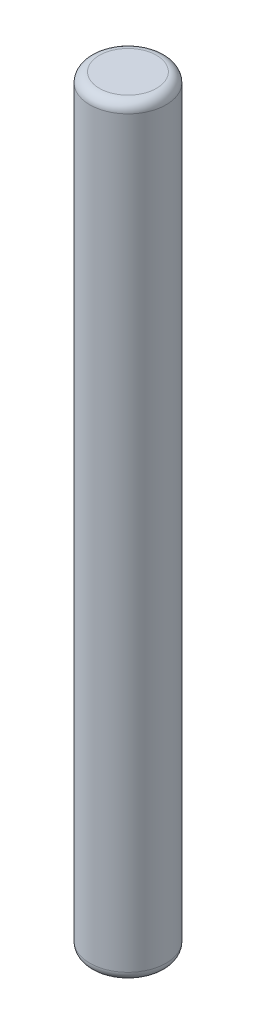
from build123d import *

# Parameters (mm, degrees)
SKETCH_1_R      = 1
EXTRUDE_1_DEPTH = 10
FILLET_1_R      = 0.25


with BuildPart() as part:
    # Sketch 1 → Extrude 1 (new, symmetric)
    with BuildSketch(Plane(origin=(0, 0, 0), x_dir=(1, 0, 0), z_dir=(0, 1, 0))):
        with Locations(Location((0, 0, 0), (0, 0, 270))):
            Circle(SKETCH_1_R)
    extrude(amount=EXTRUDE_1_DEPTH, both=True)

    # Fillet 1
    fillet_1_edges = [part.edges().sort_by_distance(p)[0] for p in [
        (0, -10, -1),
        (0, 10, -1),
    ]]
    fillet(fillet_1_edges, radius=FILLET_1_R)


solid = part.part
